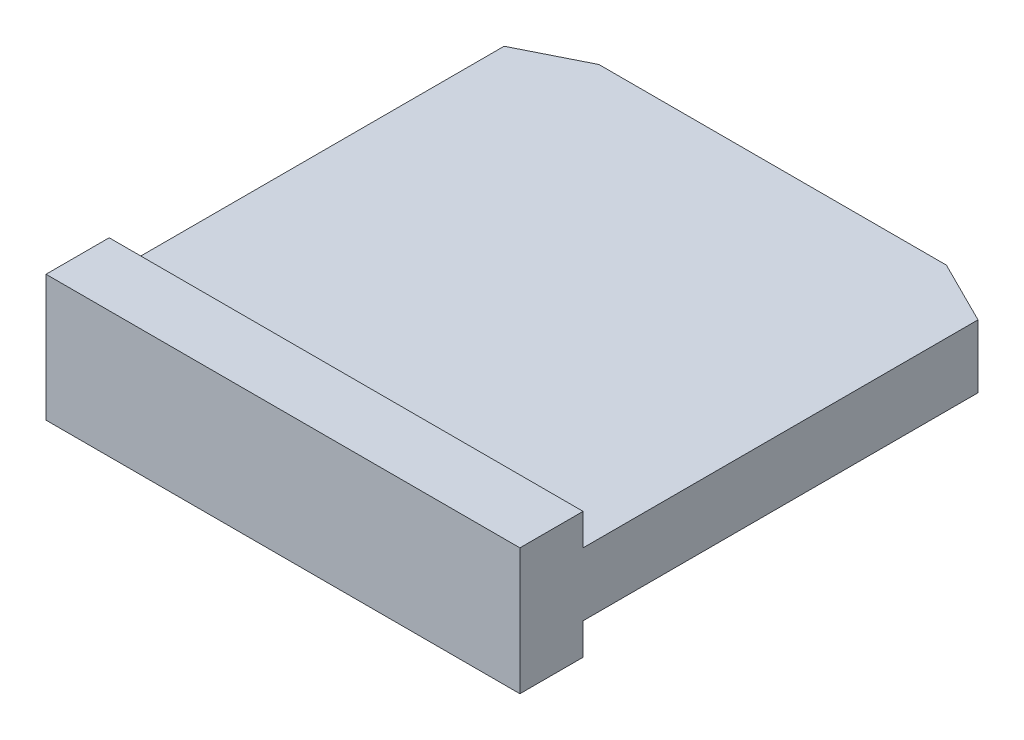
from build123d import *

# Parameters (mm, degrees)
SKETCH_1_W          = 15
SKETCH_1_H          = 4
EXTRUDE_1_DEPTH     = 15.5
SKETCH_2_OUTSIDE_W  = 21.888
SKETCH_2_OUTSIDE_H  = 10.388
CUT_EXTRUDE_1_DEPTH = 15.5
SKETCH_3_OUTSIDE_W  = 21.388
SKETCH_3_OUTSIDE_H  = 21.888
CUT_EXTRUDE_2_DEPTH = 15.5


with BuildPart() as part:
    # Sketch 1 → Extrude 1 (new body)
    with BuildSketch(Plane.XY):
        with Locations((7.5, 2)):
            Rectangle(SKETCH_1_W, SKETCH_1_H)
    extrude(amount=EXTRUDE_1_DEPTH)

    # Sketch 2 outside → Cut-Extrude 1 (cut)
    with BuildSketch(Plane(origin=(15, 0, 0), x_dir=(0, 0, -1), z_dir=(1, 0, 0))):
        with Locations((-7.75, 2)):
            Rectangle(SKETCH_2_OUTSIDE_W, SKETCH_2_OUTSIDE_H)
        Polygon((0, 1), (0, 3), (-13.5, 3), (-13.5, 4), (-15.5, 4), (-15.5, 0), (-13.5, 0), (-13.5, 1), align=None, mode=Mode.SUBTRACT)
    extrude(amount=-CUT_EXTRUDE_1_DEPTH, mode=Mode.SUBTRACT)

    # Sketch 3 outside → Cut-Extrude 2 (cut)
    with BuildSketch(Plane(origin=(0, 4, 0), x_dir=(1, 0, 0), z_dir=(0, 1, 0))):
        with Locations((7.5, -7.75)):
            Rectangle(SKETCH_3_OUTSIDE_W, SKETCH_3_OUTSIDE_H)
        Polygon((0, -15.5), (0, -1), (2, 0), (13, 0), (15, -1), (15, -15.5), align=None, mode=Mode.SUBTRACT)
    extrude(amount=-CUT_EXTRUDE_2_DEPTH, mode=Mode.SUBTRACT)


solid = part.part
